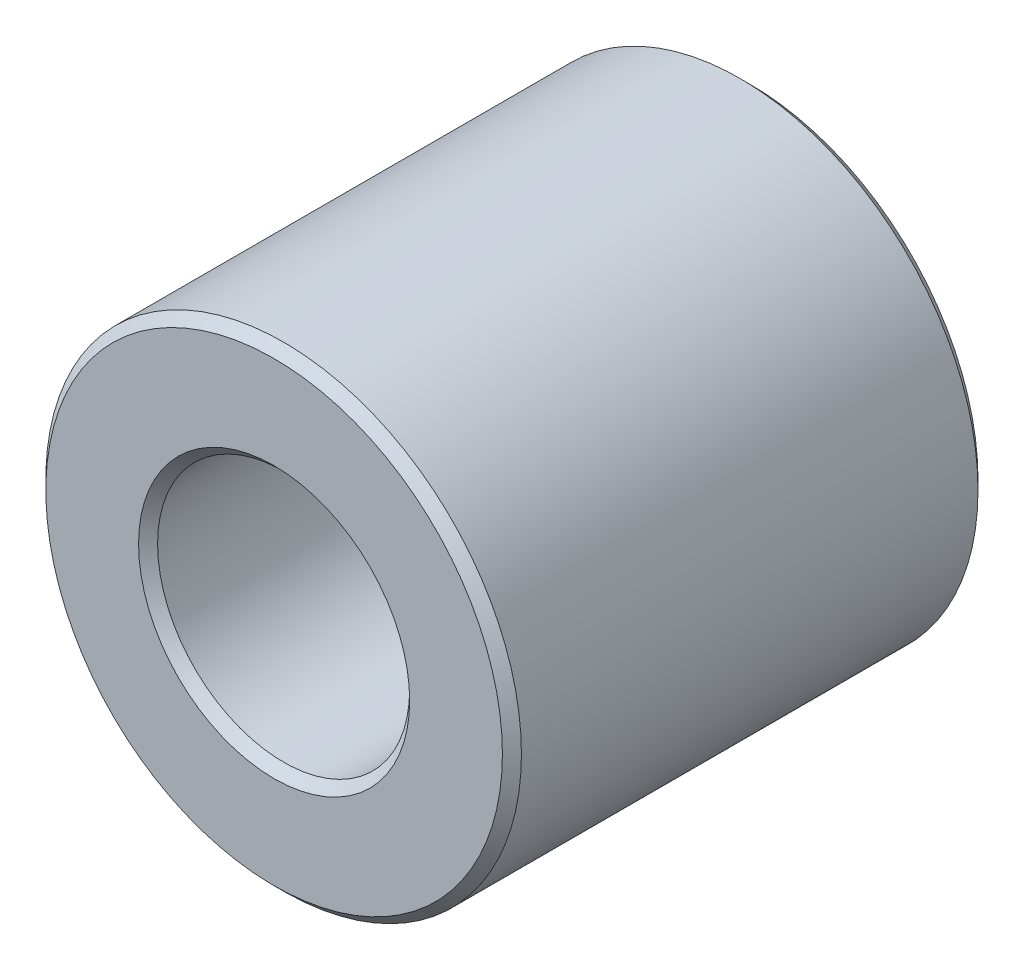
from build123d import *

# Parameters (mm, degrees)
SKETCH1_R           = 5
SKETCH1_R_2         = 2.65
BOSS_EXTRUDE2_DEPTH = 5
CHAMFER3_SIZE       = 0.2


with BuildPart() as part:
    # Sketch1 → Boss-Extrude2 (new, symmetric)
    with BuildSketch(Plane.XY):
        Circle(SKETCH1_R)
        Circle(SKETCH1_R_2, mode=Mode.SUBTRACT)
    extrude(amount=BOSS_EXTRUDE2_DEPTH, both=True)

    # Chamfer3
    chamfer3_edges = [part.edges().sort_by_distance(p)[0] for p in [
        (-5, 0, -5),
        (-5, 0, 5),
        (-2.65, 0, -5),
        (-2.65, 0, 5),
    ]]
    chamfer(chamfer3_edges, length=CHAMFER3_SIZE)


solid = part.part
